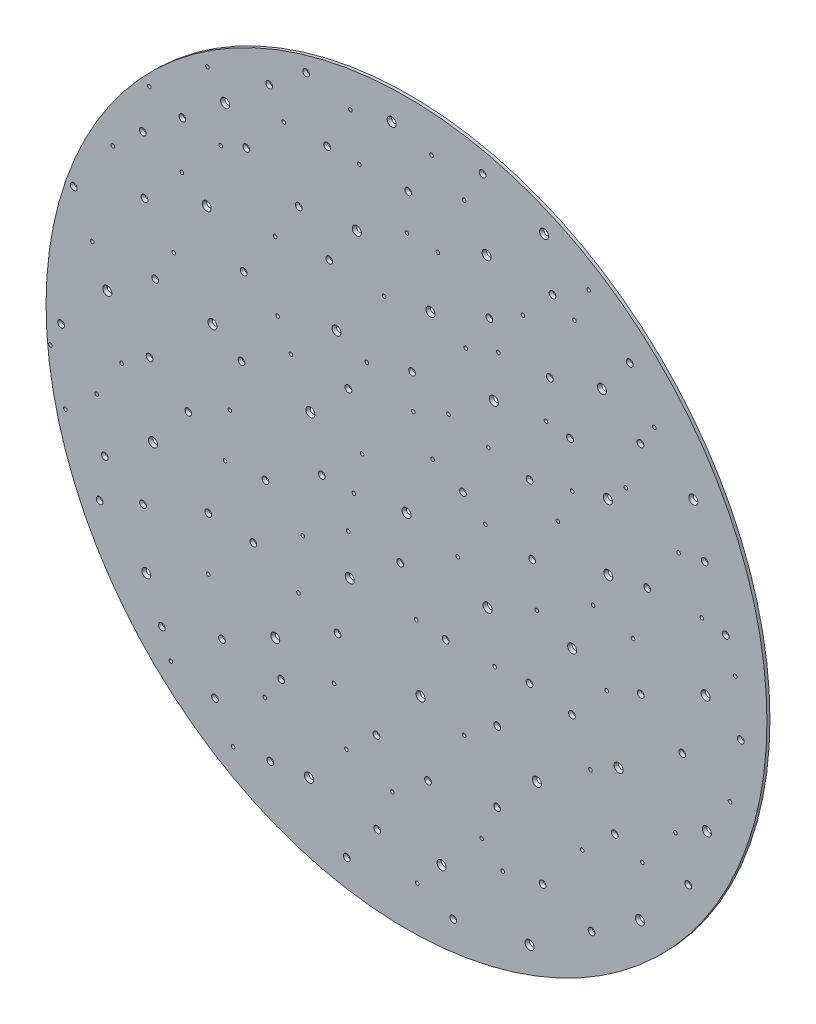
from build123d import *

# Parameters (mm, degrees)
SKIZZE1_R                       = 1200
AUFSATZ_LINEAR_AUSTRAGEN1_DEPTH = 10
BOHRUNG1_AT_2_COUNT             = 2
BOHRUNG1_AT_2_PITCH             = 551.429515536
BOHRUNG1_AT_3_COUNT             = 2
BOHRUNG1_AT_3_PITCH             = 689.850266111
BOHRUNG1_AT_4_COUNT             = 2
BOHRUNG1_AT_4_PITCH             = 624.643663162
BOHRUNG1_AT_5_COUNT             = 2
BOHRUNG1_AT_5_PITCH             = 470.937249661
BOHRUNG1_AT_6_COUNT             = 2
BOHRUNG1_AT_6_PITCH             = 345.319401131
BOHRUNG1_AT_7_COUNT             = 2
BOHRUNG1_AT_7_PITCH             = 507.888471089
BOHRUNG1_AT_8_COUNT             = 2
BOHRUNG1_AT_8_PITCH             = 563.500880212
BOHRUNG1_AT_9_COUNT             = 2
BOHRUNG1_AT_9_PITCH             = 725.092301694
BOHRUNG1_AT_10_COUNT            = 2
BOHRUNG1_AT_10_PITCH            = 871.561549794
BOHRUNG1_AT_11_COUNT            = 2
BOHRUNG1_AT_11_PITCH            = 682.736484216
BOHRUNG1_AT_12_COUNT            = 2
BOHRUNG1_AT_12_PITCH            = 1067.111703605
BOHRUNG1_AT_13_COUNT            = 2
BOHRUNG1_AT_13_PITCH            = 1104.162695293
BOHRUNG1_AT_14_COUNT            = 2
BOHRUNG1_AT_14_PITCH            = 1130.280980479
BOHRUNG1_AT_15_COUNT            = 2
BOHRUNG1_AT_15_PITCH            = 749.121236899
BOHRUNG1_AT_16_COUNT            = 2
BOHRUNG1_AT_16_PITCH            = 1085.201217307
BOHRUNG1_AT_17_COUNT            = 2
BOHRUNG1_AT_17_PITCH            = 1105.12405756
BOHRUNG1_AT_18_COUNT            = 2
BOHRUNG1_AT_18_PITCH            = 1083.832933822
BOHRUNG1_AT_19_COUNT            = 2
BOHRUNG1_AT_19_PITCH            = 707.189899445
BOHRUNG1_AT_20_COUNT            = 2
BOHRUNG1_AT_20_PITCH            = 964.220349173
BOHRUNG1_AT_21_COUNT            = 2
BOHRUNG1_AT_21_PITCH            = 980.999459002
BOHRUNG1_AT_22_COUNT            = 2
BOHRUNG1_AT_22_PITCH            = 1057.601972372
BOHRUNG1_AT_23_COUNT            = 2
BOHRUNG1_AT_23_PITCH            = 340.200565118
BOHRUNG1_AT_24_COUNT            = 2
BOHRUNG1_AT_24_PITCH            = 303.082121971
BOHRUNG1_AT_25_COUNT            = 2
BOHRUNG1_AT_25_PITCH            = 996.026604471
BOHRUNG1_AT_26_COUNT            = 2
BOHRUNG1_AT_26_PITCH            = 943.061642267
BOHRUNG1_AT_27_COUNT            = 2
BOHRUNG1_AT_27_PITCH            = 864.414824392
BOHRUNG1_AT_28_COUNT            = 2
BOHRUNG1_AT_28_PITCH            = 1006.129190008
BOHRUNG1_AT_29_COUNT            = 2
BOHRUNG1_AT_29_PITCH            = 1118.521586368
BOHRUNG1_AT_30_COUNT            = 2
BOHRUNG1_AT_30_PITCH            = 802.606587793
BOHRUNG1_AT_31_COUNT            = 2
BOHRUNG1_AT_31_PITCH            = 768.028661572
BOHRUNG1_AT_32_COUNT            = 2
BOHRUNG1_AT_32_PITCH            = 916.358242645
BOHRUNG7_AT_2_COUNT             = 2
BOHRUNG7_AT_2_PITCH             = 778.691861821
BOHRUNG7_AT_3_COUNT             = 2
BOHRUNG7_AT_3_PITCH             = 775.924424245
BOHRUNG7_AT_4_COUNT             = 2
BOHRUNG7_AT_4_PITCH             = 1117.059951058
BOHRUNG7_AT_5_COUNT             = 2
BOHRUNG7_AT_5_PITCH             = 1106.796683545
BOHRUNG7_AT_6_COUNT             = 2
BOHRUNG7_AT_6_PITCH             = 942.516952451
BOHRUNG7_AT_7_COUNT             = 2
BOHRUNG7_AT_7_PITCH             = 720.666070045
BOHRUNG7_AT_8_COUNT             = 2
BOHRUNG7_AT_8_PITCH             = 976.629632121
BOHRUNG7_AT_9_COUNT             = 2
BOHRUNG7_AT_9_PITCH             = 1290.23895934
BOHRUNG7_AT_10_COUNT            = 2
BOHRUNG7_AT_10_PITCH            = 1350.668422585
BOHRUNG7_AT_11_COUNT            = 2
BOHRUNG7_AT_11_PITCH            = 1151.003949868
BOHRUNG7_AT_12_COUNT            = 2
BOHRUNG7_AT_12_PITCH            = 1301.909217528
BOHRUNG7_AT_13_COUNT            = 2
BOHRUNG7_AT_13_PITCH            = 892.293044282
BOHRUNG7_AT_14_COUNT            = 2
BOHRUNG7_AT_14_PITCH            = 1151.056054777
BOHRUNG7_AT_15_COUNT            = 2
BOHRUNG7_AT_15_PITCH            = 897.73507688
BOHRUNG7_AT_16_COUNT            = 2
BOHRUNG7_AT_16_PITCH            = 1032.09855455
BOHRUNG7_AT_17_COUNT            = 2
BOHRUNG7_AT_17_PITCH            = 890.231681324
BOHRUNG7_AT_18_COUNT            = 2
BOHRUNG7_AT_18_PITCH            = 492.637382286
BOHRUNG7_AT_19_COUNT            = 2
BOHRUNG7_AT_19_PITCH            = 457.69221667
BOHRUNG7_AT_20_COUNT            = 2
BOHRUNG7_AT_20_PITCH            = 372.344031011
BOHRUNG7_AT_21_COUNT            = 2
BOHRUNG7_AT_21_PITCH            = 744.688062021
BOHRUNG7_AT_22_COUNT            = 2
BOHRUNG7_AT_22_PITCH            = 505.811188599
BOHRUNG7_AT_23_COUNT            = 2
BOHRUNG7_AT_23_PITCH            = 894.475248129
BOHRUNG7_AT_24_COUNT            = 2
BOHRUNG7_AT_24_PITCH            = 312.477112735
BOHRUNG7_AT_25_COUNT            = 2
BOHRUNG7_AT_25_PITCH            = 797.136127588
BOHRUNG7_AT_26_COUNT            = 2
BOHRUNG7_AT_26_PITCH            = 1082.90950687
BOHRUNG7_AT_27_COUNT            = 2
BOHRUNG7_AT_27_PITCH            = 952.976866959
BOHRUNG7_AT_28_COUNT            = 2
BOHRUNG7_AT_28_PITCH            = 555.745457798
BOHRUNG7_AT_29_COUNT            = 2
BOHRUNG7_AT_29_PITCH            = 777.990810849
BOHRUNG7_AT_30_COUNT            = 2
BOHRUNG7_AT_30_PITCH            = 855.018832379
BOHRUNG7_AT_31_COUNT            = 2
BOHRUNG7_AT_31_PITCH            = 733.878421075
BOHRUNG7_AT_32_COUNT            = 2
BOHRUNG7_AT_32_PITCH            = 265.655833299
BOHRUNG7_AT_33_COUNT            = 2
BOHRUNG7_AT_33_PITCH            = 243.188239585
BOHRUNG7_AT_34_COUNT            = 2
BOHRUNG7_AT_34_PITCH            = 396.378272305
BOHRUNG7_AT_35_COUNT            = 2
BOHRUNG7_AT_35_PITCH            = 737.621872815
BOHRUNG7_AT_36_COUNT            = 2
BOHRUNG7_AT_36_PITCH            = 1317.113271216
BOHRUNG7_AT_37_COUNT            = 2
BOHRUNG7_AT_37_PITCH            = 1037.242165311
BOHRUNG7_AT_38_COUNT            = 2
BOHRUNG7_AT_38_PITCH            = 1270.464846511
BOHRUNG7_AT_39_COUNT            = 2
BOHRUNG7_AT_39_PITCH            = 830.010095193
BOHRUNG7_AT_40_COUNT            = 2
BOHRUNG7_AT_40_PITCH            = 958.291678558
BOHRUNG7_AT_41_COUNT            = 2
BOHRUNG7_AT_41_PITCH            = 657.225829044
BOHRUNG7_AT_42_COUNT            = 2
BOHRUNG7_AT_42_PITCH            = 614.005587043
BOHRUNG7_AT_43_COUNT            = 2
BOHRUNG7_AT_43_PITCH            = 875.197635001
BOHRUNG7_AT_44_COUNT            = 2
BOHRUNG7_AT_44_PITCH            = 826.70612876
BOHRUNG7_AT_45_COUNT            = 2
BOHRUNG7_AT_45_PITCH            = 859.164110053
BOHRUNG7_AT_46_COUNT            = 2
BOHRUNG7_AT_46_PITCH            = 1305.195829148
BOHRUNG7_AT_47_COUNT            = 2
BOHRUNG7_AT_47_PITCH            = 1207.05311287
BOHRUNG7_AT_48_COUNT            = 2
BOHRUNG7_AT_48_PITCH            = 1029.91311707
BOHRUNG7_AT_49_COUNT            = 2
BOHRUNG7_AT_49_PITCH            = 1180.117131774
BOHRUNG7_AT_50_COUNT            = 2
BOHRUNG7_AT_50_PITCH            = 1069.024555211
BOHRUNG7_AT_51_COUNT            = 2
BOHRUNG7_AT_51_PITCH            = 552.788574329
BOHRUNG7_AT_52_COUNT            = 2
BOHRUNG7_AT_52_PITCH            = 855.651178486
BOHRUNG7_AT_53_COUNT            = 2
BOHRUNG7_AT_53_PITCH            = 1065.341874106
BOHRUNG7_AT_54_COUNT            = 2
BOHRUNG7_AT_54_PITCH            = 1136.220449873
BOHRUNG7_AT_55_COUNT            = 2
BOHRUNG7_AT_55_PITCH            = 1247.337552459
BOHRUNG7_AT_56_COUNT            = 2
BOHRUNG7_AT_56_PITCH            = 1340.177906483
BOHRUNG7_AT_57_COUNT            = 2
BOHRUNG7_AT_57_PITCH            = 1363.423843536
BOHRUNG7_AT_58_COUNT            = 2
BOHRUNG7_AT_58_PITCH            = 1052.047366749
BOHRUNG7_AT_59_COUNT            = 2
BOHRUNG7_AT_59_PITCH            = 488.000798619
BOHRUNG7_AT_60_COUNT            = 2
BOHRUNG7_AT_60_PITCH            = 631.216992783
BOHRUNG7_AT_61_COUNT            = 2
BOHRUNG7_AT_61_PITCH            = 958.947894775
BOHRUNG7_AT_62_COUNT            = 2
BOHRUNG7_AT_62_PITCH            = 627.398237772
BOHRUNG7_AT_63_COUNT            = 2
BOHRUNG7_AT_63_PITCH            = 585.955697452
BOHRUNG9_AT_2_COUNT             = 2
BOHRUNG9_AT_2_PITCH             = 495.770579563
BOHRUNG9_AT_3_COUNT             = 2
BOHRUNG9_AT_3_PITCH             = 297.699678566
BOHRUNG9_AT_4_COUNT             = 2
BOHRUNG9_AT_4_PITCH             = 737.571021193
BOHRUNG9_AT_5_COUNT             = 2
BOHRUNG9_AT_5_PITCH             = 371.115137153
BOHRUNG9_AT_6_COUNT             = 2
BOHRUNG9_AT_6_PITCH             = 921.353775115
BOHRUNG9_AT_7_COUNT             = 2
BOHRUNG9_AT_7_PITCH             = 869.723133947
BOHRUNG9_AT_8_COUNT             = 2
BOHRUNG9_AT_8_PITCH             = 913.970953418
BOHRUNG9_AT_9_COUNT             = 2
BOHRUNG9_AT_9_PITCH             = 1049.746683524
BOHRUNG9_AT_10_COUNT            = 2
BOHRUNG9_AT_10_PITCH            = 1156.624186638
BOHRUNG9_AT_11_COUNT            = 2
BOHRUNG9_AT_11_PITCH            = 1188.753054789
BOHRUNG9_AT_12_COUNT            = 2
BOHRUNG9_AT_12_PITCH            = 1021.656905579
BOHRUNG9_AT_13_COUNT            = 2
BOHRUNG9_AT_13_PITCH            = 642.695286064
BOHRUNG9_AT_14_COUNT            = 2
BOHRUNG9_AT_14_PITCH            = 986.120675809
BOHRUNG9_AT_15_COUNT            = 2
BOHRUNG9_AT_15_PITCH            = 1151.443829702
BOHRUNG9_AT_16_COUNT            = 2
BOHRUNG9_AT_16_PITCH            = 1198.960369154
BOHRUNG9_AT_17_COUNT            = 2
BOHRUNG9_AT_17_PITCH            = 1320.640478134
BOHRUNG9_AT_18_COUNT            = 2
BOHRUNG9_AT_18_PITCH            = 1427.302260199
BOHRUNG9_AT_19_COUNT            = 2
BOHRUNG9_AT_19_PITCH            = 679.657330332
BOHRUNG9_AT_20_COUNT            = 2
BOHRUNG9_AT_20_PITCH            = 271.978716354
BOHRUNG9_AT_21_COUNT            = 2
BOHRUNG9_AT_21_PITCH            = 584.700195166
BOHRUNG9_AT_22_COUNT            = 2
BOHRUNG9_AT_22_PITCH            = 271.916731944
BOHRUNG9_AT_23_COUNT            = 2
BOHRUNG9_AT_23_PITCH            = 226.801121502
BOHRUNG9_AT_24_COUNT            = 2
BOHRUNG9_AT_24_PITCH            = 558.795810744
BOHRUNG9_AT_25_COUNT            = 2
BOHRUNG9_AT_25_PITCH            = 703.285621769
BOHRUNG9_AT_26_COUNT            = 2
BOHRUNG9_AT_26_PITCH            = 791.847043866
BOHRUNG9_AT_27_COUNT            = 2
BOHRUNG9_AT_27_PITCH            = 273.186527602
BOHRUNG9_AT_28_COUNT            = 2
BOHRUNG9_AT_28_PITCH            = 643.262207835
BOHRUNG9_AT_29_COUNT            = 2
BOHRUNG9_AT_29_PITCH            = 702.225031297
BOHRUNG9_AT_30_COUNT            = 2
BOHRUNG9_AT_30_PITCH            = 477.396304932
BOHRUNG9_AT_31_COUNT            = 2
BOHRUNG9_AT_31_PITCH            = 508.876332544
BOHRUNG9_AT_32_COUNT            = 2
BOHRUNG9_AT_32_PITCH            = 711.820587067
BOHRUNG9_AT_33_COUNT            = 2
BOHRUNG9_AT_33_PITCH            = 789.133197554
BOHRUNG9_AT_34_COUNT            = 2
BOHRUNG9_AT_34_PITCH            = 969.022776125
BOHRUNG9_AT_35_COUNT            = 2
BOHRUNG9_AT_35_PITCH            = 1268.970789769
BOHRUNG9_AT_36_COUNT            = 2
BOHRUNG9_AT_36_PITCH            = 1094.140037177
BOHRUNG9_AT_37_COUNT            = 2
BOHRUNG9_AT_37_PITCH            = 1328.243354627
BOHRUNG9_AT_38_COUNT            = 2
BOHRUNG9_AT_38_PITCH            = 1344.295230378
BOHRUNG9_AT_39_COUNT            = 2
BOHRUNG9_AT_39_PITCH            = 967.858878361
BOHRUNG9_AT_40_COUNT            = 2
BOHRUNG9_AT_40_PITCH            = 819.574600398
BOHRUNG9_AT_41_COUNT            = 2
BOHRUNG9_AT_41_PITCH            = 953.669063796
BOHRUNG9_AT_42_COUNT            = 2
BOHRUNG9_AT_42_PITCH            = 1129.100921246
BOHRUNG9_AT_43_COUNT            = 2
BOHRUNG9_AT_43_PITCH            = 1378.033243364
BOHRUNG9_AT_44_COUNT            = 2
BOHRUNG9_AT_44_PITCH            = 1260.23685631
BOHRUNG9_AT_45_COUNT            = 2
BOHRUNG9_AT_45_PITCH            = 864.833681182
BOHRUNG9_AT_46_COUNT            = 2
BOHRUNG9_AT_46_PITCH            = 1038.155824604
BOHRUNG9_AT_47_COUNT            = 2
BOHRUNG9_AT_47_PITCH            = 999.881731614
BOHRUNG9_AT_48_COUNT            = 2
BOHRUNG9_AT_48_PITCH            = 683.860884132
BOHRUNG9_AT_49_COUNT            = 2
BOHRUNG9_AT_49_PITCH            = 651.160934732
BOHRUNG9_AT_50_COUNT            = 2
BOHRUNG9_AT_50_PITCH            = 652.87805114
BOHRUNG9_AT_51_COUNT            = 2
BOHRUNG9_AT_51_PITCH            = 937.554273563
BOHRUNG9_AT_52_COUNT            = 2
BOHRUNG9_AT_52_PITCH            = 834.135644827
BOHRUNG9_AT_53_COUNT            = 2
BOHRUNG9_AT_53_PITCH            = 609.957819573
BOHRUNG9_AT_54_COUNT            = 2
BOHRUNG9_AT_54_PITCH            = 406.773333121
BOHRUNG9_AT_55_COUNT            = 2
BOHRUNG9_AT_55_PITCH            = 167.264829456
BOHRUNG9_AT_56_COUNT            = 2
BOHRUNG9_AT_56_PITCH            = 401.534308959
BOHRUNG9_AT_57_COUNT            = 2
BOHRUNG9_AT_57_PITCH            = 276.646344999
BOHRUNG9_AT_58_COUNT            = 2
BOHRUNG9_AT_58_PITCH            = 521.131151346
BOHRUNG9_AT_59_COUNT            = 2
BOHRUNG9_AT_59_PITCH            = 811.05853425
BOHRUNG9_AT_60_COUNT            = 2
BOHRUNG9_AT_60_PITCH            = 707.994460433
BOHRUNG9_AT_61_COUNT            = 2
BOHRUNG9_AT_61_PITCH            = 388.05046838
BOHRUNG9_AT_62_COUNT            = 2
BOHRUNG9_AT_62_PITCH            = 502.688209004
BOHRUNG9_AT_63_COUNT            = 2
BOHRUNG9_AT_63_PITCH            = 459.539522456
BOHRUNG9_AT_64_COUNT            = 2
BOHRUNG9_AT_64_PITCH            = 619.973684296
BOHRUNG9_AT_65_COUNT            = 2
BOHRUNG9_AT_65_PITCH            = 618.933085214
BOHRUNG9_AT_66_COUNT            = 2
BOHRUNG9_AT_66_PITCH            = 661.01535915
BOHRUNG9_AT_67_COUNT            = 2
BOHRUNG9_AT_67_PITCH            = 844.007979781
BOHRUNG9_AT_68_COUNT            = 2
BOHRUNG9_AT_68_PITCH            = 1185.582954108
BOHRUNG9_AT_69_COUNT            = 2
BOHRUNG9_AT_69_PITCH            = 1403.289340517
BOHRUNG9_AT_70_COUNT            = 2
BOHRUNG9_AT_70_PITCH            = 1355.144521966
BOHRUNG9_AT_71_COUNT            = 2
BOHRUNG9_AT_71_PITCH            = 1241.430059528


with BuildPart() as part:
    # Skizze1 → Aufsatz-Linear austragen1 (new body)
    with BuildSketch(Plane.XY):
        Circle(SKIZZE1_R)
    extrude(amount=-AUFSATZ_LINEAR_AUSTRAGEN1_DEPTH)

    # Skizze3 → Bohrung1 (revolve, cut)
    with BuildSketch(Plane(origin=(0, 0, 0), x_dir=(0, -1, 0), z_dir=(1, 0, 0))):
        Polygon((0, 0), (0, 16.00860619), (10, 10), (15, 0), align=None)
    bohrung1 = revolve(axis=Axis((0, 0, 9.901672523), (0, 0, -1)), mode=Mode.SUBTRACT)

    # Bohrung1 at 2: Bohrung1 ×2
    with Locations(*[Vector(0.5271354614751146, 0.849781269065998, 0) * (i * BOHRUNG1_AT_2_PITCH) for i in range(1, BOHRUNG1_AT_2_COUNT)]):
        add(bohrung1, mode=Mode.SUBTRACT)

    # Bohrung1 at 3: Bohrung1 ×2
    with Locations(*[Vector(0.9738412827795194, 0.2272293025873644, 0) * (i * BOHRUNG1_AT_3_PITCH) for i in range(1, BOHRUNG1_AT_3_COUNT)]):
        add(bohrung1, mode=Mode.SUBTRACT)

    # Bohrung1 at 4: Bohrung1 ×2
    with Locations(*[Vector(0.12792504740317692, 0.9917838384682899, 0) * (i * BOHRUNG1_AT_4_PITCH) for i in range(1, BOHRUNG1_AT_4_COUNT)]):
        add(bohrung1, mode=Mode.SUBTRACT)

    # Bohrung1 at 5: Bohrung1 ×2
    with Locations(*[Vector(-0.4948777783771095, 0.868962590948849, 0) * (i * BOHRUNG1_AT_5_PITCH) for i in range(1, BOHRUNG1_AT_5_COUNT)]):
        add(bohrung1, mode=Mode.SUBTRACT)

    # Bohrung1 at 6: Bohrung1 ×2
    with Locations(*[Vector(-0.9265125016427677, 0.37626398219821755, 0) * (i * BOHRUNG1_AT_6_PITCH) for i in range(1, BOHRUNG1_AT_6_COUNT)]):
        add(bohrung1, mode=Mode.SUBTRACT)

    # Bohrung1 at 7: Bohrung1 ×2
    with Locations(*[Vector(0.09238634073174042, -0.9957232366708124, 0) * (i * BOHRUNG1_AT_7_PITCH) for i in range(1, BOHRUNG1_AT_7_COUNT)]):
        add(bohrung1, mode=Mode.SUBTRACT)

    # Bohrung1 at 8: Bohrung1 ×2
    with Locations(*[Vector(0.9788925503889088, -0.2043755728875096, 0) * (i * BOHRUNG1_AT_8_PITCH) for i in range(1, BOHRUNG1_AT_8_COUNT)]):
        add(bohrung1, mode=Mode.SUBTRACT)

    # Bohrung1 at 9: Bohrung1 ×2
    with Locations(*[Vector(-0.6026113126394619, -0.7980348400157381, 0) * (i * BOHRUNG1_AT_9_PITCH) for i in range(1, BOHRUNG1_AT_9_COUNT)]):
        add(bohrung1, mode=Mode.SUBTRACT)

    # Bohrung1 at 10: Bohrung1 ×2
    with Locations(*[Vector(-0.9680709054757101, -0.2506765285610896, 0) * (i * BOHRUNG1_AT_10_PITCH) for i in range(1, BOHRUNG1_AT_10_COUNT)]):
        add(bohrung1, mode=Mode.SUBTRACT)

    # Bohrung1 at 11: Bohrung1 ×2
    with Locations(*[Vector(-0.9461260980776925, 0.3237984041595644, 0) * (i * BOHRUNG1_AT_11_PITCH) for i in range(1, BOHRUNG1_AT_11_COUNT)]):
        add(bohrung1, mode=Mode.SUBTRACT)

    # Bohrung1 at 12: Bohrung1 ×2
    with Locations(*[Vector(-0.565803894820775, 0.8245398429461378, 0) * (i * BOHRUNG1_AT_12_PITCH) for i in range(1, BOHRUNG1_AT_12_COUNT)]):
        add(bohrung1, mode=Mode.SUBTRACT)

    # Bohrung1 at 13: Bohrung1 ×2
    with Locations(*[Vector(-0.04476452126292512, 0.9989975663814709, 0) * (i * BOHRUNG1_AT_13_PITCH) for i in range(1, BOHRUNG1_AT_13_COUNT)]):
        add(bohrung1, mode=Mode.SUBTRACT)

    # Bohrung1 at 14: Bohrung1 ×2
    with Locations(*[Vector(0.4051192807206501, 0.9142638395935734, 0) * (i * BOHRUNG1_AT_14_PITCH) for i in range(1, BOHRUNG1_AT_14_COUNT)]):
        add(bohrung1, mode=Mode.SUBTRACT)

    # Bohrung1 at 15: Bohrung1 ×2
    with Locations(*[Vector(-0.22062623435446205, 0.9753584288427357, 0) * (i * BOHRUNG1_AT_15_PITCH) for i in range(1, BOHRUNG1_AT_15_COUNT)]):
        add(bohrung1, mode=Mode.SUBTRACT)

    # Bohrung1 at 16: Bohrung1 ×2
    with Locations(*[Vector(0.8798011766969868, 0.47534186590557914, 0) * (i * BOHRUNG1_AT_16_PITCH) for i in range(1, BOHRUNG1_AT_16_COUNT)]):
        add(bohrung1, mode=Mode.SUBTRACT)

    # Bohrung1 at 17: Bohrung1 ×2
    with Locations(*[Vector(0.7031077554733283, -0.7110833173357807, 0) * (i * BOHRUNG1_AT_17_PITCH) for i in range(1, BOHRUNG1_AT_17_COUNT)]):
        add(bohrung1, mode=Mode.SUBTRACT)

    # Bohrung1 at 18: Bohrung1 ×2
    with Locations(*[Vector(0.9225657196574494, -0.38583998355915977, 0) * (i * BOHRUNG1_AT_18_PITCH) for i in range(1, BOHRUNG1_AT_18_COUNT)]):
        add(bohrung1, mode=Mode.SUBTRACT)

    # Bohrung1 at 19: Bohrung1 ×2
    with Locations(*[Vector(0.6138467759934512, -0.7894251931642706, 0) * (i * BOHRUNG1_AT_19_PITCH) for i in range(1, BOHRUNG1_AT_19_COUNT)]):
        add(bohrung1, mode=Mode.SUBTRACT)

    # Bohrung1 at 20: Bohrung1 ×2
    with Locations(*[Vector(0.12106850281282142, -0.9926441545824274, 0) * (i * BOHRUNG1_AT_20_PITCH) for i in range(1, BOHRUNG1_AT_20_COUNT)]):
        add(bohrung1, mode=Mode.SUBTRACT)

    # Bohrung1 at 21: Bohrung1 ×2
    with Locations(*[Vector(-0.33080235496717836, -0.9437000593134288, 0) * (i * BOHRUNG1_AT_21_PITCH) for i in range(1, BOHRUNG1_AT_21_COUNT)]):
        add(bohrung1, mode=Mode.SUBTRACT)

    # Bohrung1 at 22: Bohrung1 ×2
    with Locations(*[Vector(-0.8190222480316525, -0.5737617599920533, 0) * (i * BOHRUNG1_AT_22_PITCH) for i in range(1, BOHRUNG1_AT_22_COUNT)]):
        add(bohrung1, mode=Mode.SUBTRACT)

    # Bohrung1 at 23: Bohrung1 ×2
    with Locations(*[Vector(-0.5554246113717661, -0.8315668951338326, 0) * (i * BOHRUNG1_AT_23_PITCH) for i in range(1, BOHRUNG1_AT_23_COUNT)]):
        add(bohrung1, mode=Mode.SUBTRACT)

    # Bohrung1 at 24: Bohrung1 ×2
    with Locations(*[Vector(0.8902134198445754, -0.4555437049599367, 0) * (i * BOHRUNG1_AT_24_PITCH) for i in range(1, BOHRUNG1_AT_24_COUNT)]):
        add(bohrung1, mode=Mode.SUBTRACT)

    # Bohrung1 at 25: Bohrung1 ×2
    with Locations(*[Vector(0.9995856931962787, -0.02878266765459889, 0) * (i * BOHRUNG1_AT_25_PITCH) for i in range(1, BOHRUNG1_AT_25_COUNT)]):
        add(bohrung1, mode=Mode.SUBTRACT)

    # Bohrung1 at 26: Bohrung1 ×2
    with Locations(*[Vector(0.6898896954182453, 0.7239145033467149, 0) * (i * BOHRUNG1_AT_26_PITCH) for i in range(1, BOHRUNG1_AT_26_COUNT)]):
        add(bohrung1, mode=Mode.SUBTRACT)

    # Bohrung1 at 27: Bohrung1 ×2
    with Locations(*[Vector(-0.7693116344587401, 0.638873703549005, 0) * (i * BOHRUNG1_AT_27_PITCH) for i in range(1, BOHRUNG1_AT_27_COUNT)]):
        add(bohrung1, mode=Mode.SUBTRACT)

    # Bohrung1 at 28: Bohrung1 ×2
    with Locations(*[Vector(-0.9899612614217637, 0.1413389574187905, 0) * (i * BOHRUNG1_AT_28_PITCH) for i in range(1, BOHRUNG1_AT_28_COUNT)]):
        add(bohrung1, mode=Mode.SUBTRACT)

    # Bohrung1 at 29: Bohrung1 ×2
    with Locations(*[Vector(0.36605219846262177, -0.9305943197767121, 0) * (i * BOHRUNG1_AT_29_PITCH) for i in range(1, BOHRUNG1_AT_29_COUNT)]):
        add(bohrung1, mode=Mode.SUBTRACT)

    # Bohrung1 at 30: Bohrung1 ×2
    with Locations(*[Vector(0.8797649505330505, -0.475408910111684, 0) * (i * BOHRUNG1_AT_30_PITCH) for i in range(1, BOHRUNG1_AT_30_COUNT)]):
        add(bohrung1, mode=Mode.SUBTRACT)

    # Bohrung1 at 31: Bohrung1 ×2
    with Locations(*[Vector(0.872635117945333, 0.4883727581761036, 0) * (i * BOHRUNG1_AT_31_PITCH) for i in range(1, BOHRUNG1_AT_31_COUNT)]):
        add(bohrung1, mode=Mode.SUBTRACT)

    # Bohrung1 at 32: Bohrung1 ×2
    with Locations(*[Vector(0.2910743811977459, 0.9567004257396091, 0) * (i * BOHRUNG1_AT_32_PITCH) for i in range(1, BOHRUNG1_AT_32_COUNT)]):
        add(bohrung1, mode=Mode.SUBTRACT)

    # Skizze14 → Bohrung7 (revolve, cut)
    with BuildSketch(Plane(origin=(188.194538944, 153.573437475, 0), x_dir=(0, -1, 0), z_dir=(1, 0, 0))):
        Polygon((0, 0), (0, 10), (7.5, 10), (11.25, 0), align=None)
    bohrung7 = revolve(axis=Axis((188.194538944, 153.573437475, -110), (0, 0, 1)), mode=Mode.SUBTRACT)

    # Bohrung7 at 2: Bohrung7 ×2
    with Locations(*[Vector(-0.9377242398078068, 0.34738055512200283, 0) * (i * BOHRUNG7_AT_2_PITCH) for i in range(1, BOHRUNG7_AT_2_COUNT)]):
        add(bohrung7, mode=Mode.SUBTRACT)

    # Bohrung7 at 3: Bohrung7 ×2
    with Locations(*[Vector(-0.7049510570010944, 0.7092559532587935, 0) * (i * BOHRUNG7_AT_3_PITCH) for i in range(1, BOHRUNG7_AT_3_COUNT)]):
        add(bohrung7, mode=Mode.SUBTRACT)

    # Bohrung7 at 4: Bohrung7 ×2
    with Locations(*[Vector(-0.8363988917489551, 0.5481212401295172, 0) * (i * BOHRUNG7_AT_4_PITCH) for i in range(1, BOHRUNG7_AT_4_COUNT)]):
        add(bohrung7, mode=Mode.SUBTRACT)

    # Bohrung7 at 5: Bohrung7 ×2
    with Locations(*[Vector(-0.9580383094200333, 0.2866401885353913, 0) * (i * BOHRUNG7_AT_5_PITCH) for i in range(1, BOHRUNG7_AT_5_COUNT)]):
        add(bohrung7, mode=Mode.SUBTRACT)

    # Bohrung7 at 6: Bohrung7 ×2
    with Locations(*[Vector(-0.9708322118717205, -0.2397599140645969, 0) * (i * BOHRUNG7_AT_6_PITCH) for i in range(1, BOHRUNG7_AT_6_COUNT)]):
        add(bohrung7, mode=Mode.SUBTRACT)

    # Bohrung7 at 7: Bohrung7 ×2
    with Locations(*[Vector(-0.9127524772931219, -0.40851305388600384, 0) * (i * BOHRUNG7_AT_7_PITCH) for i in range(1, BOHRUNG7_AT_7_COUNT)]):
        add(bohrung7, mode=Mode.SUBTRACT)

    # Bohrung7 at 8: Bohrung7 ×2
    with Locations(*[Vector(-0.8683619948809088, -0.4959308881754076, 0) * (i * BOHRUNG7_AT_8_PITCH) for i in range(1, BOHRUNG7_AT_8_COUNT)]):
        add(bohrung7, mode=Mode.SUBTRACT)

    # Bohrung7 at 9: Bohrung7 ×2
    with Locations(*[Vector(-0.9242981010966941, -0.3816713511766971, 0) * (i * BOHRUNG7_AT_9_PITCH) for i in range(1, BOHRUNG7_AT_9_COUNT)]):
        add(bohrung7, mode=Mode.SUBTRACT)

    # Bohrung7 at 10: Bohrung7 ×2
    with Locations(*[Vector(-0.9906928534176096, -0.13611638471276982, 0) * (i * BOHRUNG7_AT_10_PITCH) for i in range(1, BOHRUNG7_AT_10_COUNT)]):
        add(bohrung7, mode=Mode.SUBTRACT)

    # Bohrung7 at 11: Bohrung7 ×2
    with Locations(*[Vector(-0.6973245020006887, -0.7167555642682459, 0) * (i * BOHRUNG7_AT_11_PITCH) for i in range(1, BOHRUNG7_AT_11_COUNT)]):
        add(bohrung7, mode=Mode.SUBTRACT)

    # Bohrung7 at 12: Bohrung7 ×2
    with Locations(*[Vector(-0.6341856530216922, -0.7731808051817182, 0) * (i * BOHRUNG7_AT_12_PITCH) for i in range(1, BOHRUNG7_AT_12_COUNT)]):
        add(bohrung7, mode=Mode.SUBTRACT)

    # Bohrung7 at 13: Bohrung7 ×2
    with Locations(*[Vector(-0.32281876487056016, -0.9464607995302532, 0) * (i * BOHRUNG7_AT_13_PITCH) for i in range(1, BOHRUNG7_AT_13_COUNT)]):
        add(bohrung7, mode=Mode.SUBTRACT)

    # Bohrung7 at 14: Bohrung7 ×2
    with Locations(*[Vector(-0.24796858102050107, -0.9687680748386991, 0) * (i * BOHRUNG7_AT_14_PITCH) for i in range(1, BOHRUNG7_AT_14_COUNT)]):
        add(bohrung7, mode=Mode.SUBTRACT)

    # Bohrung7 at 15: Bohrung7 ×2
    with Locations(*[Vector(-0.12983587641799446, -0.9915354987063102, 0) * (i * BOHRUNG7_AT_15_PITCH) for i in range(1, BOHRUNG7_AT_15_COUNT)]):
        add(bohrung7, mode=Mode.SUBTRACT)

    # Bohrung7 at 16: Bohrung7 ×2
    with Locations(*[Vector(0.25676183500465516, -0.9664747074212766, 0) * (i * BOHRUNG7_AT_16_PITCH) for i in range(1, BOHRUNG7_AT_16_COUNT)]):
        add(bohrung7, mode=Mode.SUBTRACT)

    # Bohrung7 at 17: Bohrung7 ×2
    with Locations(*[Vector(0.5676910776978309, -0.8232416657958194, 0) * (i * BOHRUNG7_AT_17_PITCH) for i in range(1, BOHRUNG7_AT_17_COUNT)]):
        add(bohrung7, mode=Mode.SUBTRACT)

    # Bohrung7 at 18: Bohrung7 ×2
    with Locations(*[Vector(0.4489647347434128, -0.8935494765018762, 0) * (i * BOHRUNG7_AT_18_PITCH) for i in range(1, BOHRUNG7_AT_18_COUNT)]):
        add(bohrung7, mode=Mode.SUBTRACT)

    # Bohrung7 at 19: Bohrung7 ×2
    with Locations(*[Vector(-0.1257880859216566, -0.9920571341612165, 0) * (i * BOHRUNG7_AT_19_PITCH) for i in range(1, BOHRUNG7_AT_19_COUNT)]):
        add(bohrung7, mode=Mode.SUBTRACT)

    # Bohrung7 at 20: Bohrung7 ×2
    with Locations(*[Vector(-0.5612114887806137, -0.8276724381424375, 0) * (i * BOHRUNG7_AT_20_PITCH) for i in range(1, BOHRUNG7_AT_20_COUNT)]):
        add(bohrung7, mode=Mode.SUBTRACT)

    # Bohrung7 at 21: Bohrung7 ×2
    with Locations(*[Vector(-0.561211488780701, -0.8276724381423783, 0) * (i * BOHRUNG7_AT_21_PITCH) for i in range(1, BOHRUNG7_AT_21_COUNT)]):
        add(bohrung7, mode=Mode.SUBTRACT)

    # Bohrung7 at 22: Bohrung7 ×2
    with Locations(*[Vector(-0.9300725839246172, -0.36737581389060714, 0) * (i * BOHRUNG7_AT_22_PITCH) for i in range(1, BOHRUNG7_AT_22_COUNT)]):
        add(bohrung7, mode=Mode.SUBTRACT)

    # Bohrung7 at 23: Bohrung7 ×2
    with Locations(*[Vector(-0.5058321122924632, 0.8626319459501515, 0) * (i * BOHRUNG7_AT_23_PITCH) for i in range(1, BOHRUNG7_AT_23_COUNT)]):
        add(bohrung7, mode=Mode.SUBTRACT)

    # Bohrung7 at 24: Bohrung7 ×2
    with Locations(*[Vector(-0.543632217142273, 0.8393235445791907, 0) * (i * BOHRUNG7_AT_24_PITCH) for i in range(1, BOHRUNG7_AT_24_COUNT)]):
        add(bohrung7, mode=Mode.SUBTRACT)

    # Bohrung7 at 25: Bohrung7 ×2
    with Locations(*[Vector(-0.2286811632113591, 0.9735013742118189, 0) * (i * BOHRUNG7_AT_25_PITCH) for i in range(1, BOHRUNG7_AT_25_COUNT)]):
        add(bohrung7, mode=Mode.SUBTRACT)

    # Bohrung7 at 26: Bohrung7 ×2
    with Locations(*[Vector(-0.4823503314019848, 0.875978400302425, 0) * (i * BOHRUNG7_AT_26_PITCH) for i in range(1, BOHRUNG7_AT_26_COUNT)]):
        add(bohrung7, mode=Mode.SUBTRACT)

    # Bohrung7 at 27: Bohrung7 ×2
    with Locations(*[Vector(0.06836668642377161, 0.9976602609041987, 0) * (i * BOHRUNG7_AT_27_PITCH) for i in range(1, BOHRUNG7_AT_27_COUNT)]):
        add(bohrung7, mode=Mode.SUBTRACT)

    # Bohrung7 at 28: Bohrung7 ×2
    with Locations(*[Vector(0.5203033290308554, 0.8539815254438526, 0) * (i * BOHRUNG7_AT_28_PITCH) for i in range(1, BOHRUNG7_AT_28_COUNT)]):
        add(bohrung7, mode=Mode.SUBTRACT)

    # Bohrung7 at 29: Bohrung7 ×2
    with Locations(*[Vector(0.38296762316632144, 0.9237617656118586, 0) * (i * BOHRUNG7_AT_29_PITCH) for i in range(1, BOHRUNG7_AT_29_COUNT)]):
        add(bohrung7, mode=Mode.SUBTRACT)

    # Bohrung7 at 30: Bohrung7 ×2
    with Locations(*[Vector(0.6493206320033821, 0.7605147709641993, 0) * (i * BOHRUNG7_AT_30_PITCH) for i in range(1, BOHRUNG7_AT_30_COUNT)]):
        add(bohrung7, mode=Mode.SUBTRACT)

    # Bohrung7 at 31: Bohrung7 ×2
    with Locations(*[Vector(0.8049423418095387, 0.5933530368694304, 0) * (i * BOHRUNG7_AT_31_PITCH) for i in range(1, BOHRUNG7_AT_31_COUNT)]):
        add(bohrung7, mode=Mode.SUBTRACT)

    # Bohrung7 at 32: Bohrung7 ×2
    with Locations(*[Vector(0.8344918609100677, 0.5510202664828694, 0) * (i * BOHRUNG7_AT_32_PITCH) for i in range(1, BOHRUNG7_AT_32_COUNT)]):
        add(bohrung7, mode=Mode.SUBTRACT)

    # Bohrung7 at 33: Bohrung7 ×2
    with Locations(*[Vector(0.9460492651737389, -0.32402281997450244, 0) * (i * BOHRUNG7_AT_33_PITCH) for i in range(1, BOHRUNG7_AT_33_COUNT)]):
        add(bohrung7, mode=Mode.SUBTRACT)

    # Bohrung7 at 34: Bohrung7 ×2
    with Locations(*[Vector(-0.9626202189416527, 0.2708547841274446, 0) * (i * BOHRUNG7_AT_34_PITCH) for i in range(1, BOHRUNG7_AT_34_COUNT)]):
        add(bohrung7, mode=Mode.SUBTRACT)

    # Bohrung7 at 35: Bohrung7 ×2
    with Locations(*[Vector(-0.9999344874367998, 0.01144643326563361, 0) * (i * BOHRUNG7_AT_35_PITCH) for i in range(1, BOHRUNG7_AT_35_COUNT)]):
        add(bohrung7, mode=Mode.SUBTRACT)

    # Bohrung7 at 36: Bohrung7 ×2
    with Locations(*[Vector(-0.9841834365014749, 0.17715237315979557, 0) * (i * BOHRUNG7_AT_36_PITCH) for i in range(1, BOHRUNG7_AT_36_COUNT)]):
        add(bohrung7, mode=Mode.SUBTRACT)

    # Bohrung7 at 37: Bohrung7 ×2
    with Locations(*[Vector(-0.5836421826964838, -0.8120109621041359, 0) * (i * BOHRUNG7_AT_37_PITCH) for i in range(1, BOHRUNG7_AT_37_COUNT)]):
        add(bohrung7, mode=Mode.SUBTRACT)

    # Bohrung7 at 38: Bohrung7 ×2
    with Locations(*[Vector(-0.5048037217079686, -0.8632341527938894, 0) * (i * BOHRUNG7_AT_38_PITCH) for i in range(1, BOHRUNG7_AT_38_COUNT)]):
        add(bohrung7, mode=Mode.SUBTRACT)

    # Bohrung7 at 39: Bohrung7 ×2
    with Locations(*[Vector(0.969795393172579, 0.2439198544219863, 0) * (i * BOHRUNG7_AT_39_PITCH) for i in range(1, BOHRUNG7_AT_39_COUNT)]):
        add(bohrung7, mode=Mode.SUBTRACT)

    # Bohrung7 at 40: Bohrung7 ×2
    with Locations(*[Vector(0.9648582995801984, -0.2627707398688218, 0) * (i * BOHRUNG7_AT_40_PITCH) for i in range(1, BOHRUNG7_AT_40_COUNT)]):
        add(bohrung7, mode=Mode.SUBTRACT)

    # Bohrung7 at 41: Bohrung7 ×2
    with Locations(*[Vector(0.9000416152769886, -0.435803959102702, 0) * (i * BOHRUNG7_AT_41_PITCH) for i in range(1, BOHRUNG7_AT_41_COUNT)]):
        add(bohrung7, mode=Mode.SUBTRACT)

    # Bohrung7 at 42: Bohrung7 ×2
    with Locations(*[Vector(0.9987659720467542, 0.04966420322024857, 0) * (i * BOHRUNG7_AT_42_PITCH) for i in range(1, BOHRUNG7_AT_42_COUNT)]):
        add(bohrung7, mode=Mode.SUBTRACT)

    # Bohrung7 at 43: Bohrung7 ×2
    with Locations(*[Vector(0.9995769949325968, 0.029083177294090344, 0) * (i * BOHRUNG7_AT_43_PITCH) for i in range(1, BOHRUNG7_AT_43_COUNT)]):
        add(bohrung7, mode=Mode.SUBTRACT)

    # Bohrung7 at 44: Bohrung7 ×2
    with Locations(*[Vector(0.8831385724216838, -0.4691122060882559, 0) * (i * BOHRUNG7_AT_44_PITCH) for i in range(1, BOHRUNG7_AT_44_COUNT)]):
        add(bohrung7, mode=Mode.SUBTRACT)

    # Bohrung7 at 45: Bohrung7 ×2
    with Locations(*[Vector(0.13223550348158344, -0.9912183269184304, 0) * (i * BOHRUNG7_AT_45_PITCH) for i in range(1, BOHRUNG7_AT_45_COUNT)]):
        add(bohrung7, mode=Mode.SUBTRACT)

    # Bohrung7 at 46: Bohrung7 ×2
    with Locations(*[Vector(-0.29652944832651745, -0.955023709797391, 0) * (i * BOHRUNG7_AT_46_PITCH) for i in range(1, BOHRUNG7_AT_46_COUNT)]):
        add(bohrung7, mode=Mode.SUBTRACT)

    # Bohrung7 at 47: Bohrung7 ×2
    with Locations(*[Vector(-0.8826556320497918, -0.4700202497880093, 0) * (i * BOHRUNG7_AT_47_PITCH) for i in range(1, BOHRUNG7_AT_47_COUNT)]):
        add(bohrung7, mode=Mode.SUBTRACT)

    # Bohrung7 at 48: Bohrung7 ×2
    with Locations(*[Vector(-0.9950404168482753, 0.09947144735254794, 0) * (i * BOHRUNG7_AT_48_PITCH) for i in range(1, BOHRUNG7_AT_48_COUNT)]):
        add(bohrung7, mode=Mode.SUBTRACT)

    # Bohrung7 at 49: Bohrung7 ×2
    with Locations(*[Vector(-0.9032209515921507, 0.4291758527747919, 0) * (i * BOHRUNG7_AT_49_PITCH) for i in range(1, BOHRUNG7_AT_49_COUNT)]):
        add(bohrung7, mode=Mode.SUBTRACT)

    # Bohrung7 at 50: Bohrung7 ×2
    with Locations(*[Vector(-0.60368662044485, 0.79722171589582, 0) * (i * BOHRUNG7_AT_50_PITCH) for i in range(1, BOHRUNG7_AT_50_COUNT)]):
        add(bohrung7, mode=Mode.SUBTRACT)

    # Bohrung7 at 51: Bohrung7 ×2
    with Locations(*[Vector(0.15859579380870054, 0.9873435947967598, 0) * (i * BOHRUNG7_AT_51_PITCH) for i in range(1, BOHRUNG7_AT_51_COUNT)]):
        add(bohrung7, mode=Mode.SUBTRACT)

    # Bohrung7 at 52: Bohrung7 ×2
    with Locations(*[Vector(-0.8157391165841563, -0.5784199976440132, 0) * (i * BOHRUNG7_AT_52_PITCH) for i in range(1, BOHRUNG7_AT_52_COUNT)]):
        add(bohrung7, mode=Mode.SUBTRACT)

    # Bohrung7 at 53: Bohrung7 ×2
    with Locations(*[Vector(0.7037990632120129, -0.7103990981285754, 0) * (i * BOHRUNG7_AT_53_PITCH) for i in range(1, BOHRUNG7_AT_53_COUNT)]):
        add(bohrung7, mode=Mode.SUBTRACT)

    # Bohrung7 at 54: Bohrung7 ×2
    with Locations(*[Vector(0.37660780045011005, -0.926372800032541, 0) * (i * BOHRUNG7_AT_54_PITCH) for i in range(1, BOHRUNG7_AT_54_COUNT)]):
        add(bohrung7, mode=Mode.SUBTRACT)

    # Bohrung7 at 55: Bohrung7 ×2
    with Locations(*[Vector(-0.026082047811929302, -0.9996598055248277, 0) * (i * BOHRUNG7_AT_55_PITCH) for i in range(1, BOHRUNG7_AT_55_COUNT)]):
        add(bohrung7, mode=Mode.SUBTRACT)

    # Bohrung7 at 56: Bohrung7 ×2
    with Locations(*[Vector(-0.7482573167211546, -0.6634086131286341, 0) * (i * BOHRUNG7_AT_56_PITCH) for i in range(1, BOHRUNG7_AT_56_COUNT)]):
        add(bohrung7, mode=Mode.SUBTRACT)

    # Bohrung7 at 57: Bohrung7 ×2
    with Locations(*[Vector(-0.8873521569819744, -0.4610923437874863, 0) * (i * BOHRUNG7_AT_57_PITCH) for i in range(1, BOHRUNG7_AT_57_COUNT)]):
        add(bohrung7, mode=Mode.SUBTRACT)

    # Bohrung7 at 58: Bohrung7 ×2
    with Locations(*[Vector(-0.9919636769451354, -0.12652297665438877, 0) * (i * BOHRUNG7_AT_58_PITCH) for i in range(1, BOHRUNG7_AT_58_COUNT)]):
        add(bohrung7, mode=Mode.SUBTRACT)

    # Bohrung7 at 59: Bohrung7 ×2
    with Locations(*[Vector(0.7299499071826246, 0.6835006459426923, 0) * (i * BOHRUNG7_AT_59_PITCH) for i in range(1, BOHRUNG7_AT_59_COUNT)]):
        add(bohrung7, mode=Mode.SUBTRACT)

    # Bohrung7 at 60: Bohrung7 ×2
    with Locations(*[Vector(-0.7059217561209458, 0.7082898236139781, 0) * (i * BOHRUNG7_AT_60_PITCH) for i in range(1, BOHRUNG7_AT_60_COUNT)]):
        add(bohrung7, mode=Mode.SUBTRACT)

    # Bohrung7 at 61: Bohrung7 ×2
    with Locations(*[Vector(-0.7521858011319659, 0.6589510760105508, 0) * (i * BOHRUNG7_AT_61_PITCH) for i in range(1, BOHRUNG7_AT_61_COUNT)]):
        add(bohrung7, mode=Mode.SUBTRACT)

    # Bohrung7 at 62: Bohrung7 ×2
    with Locations(*[Vector(0.1814100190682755, -0.9834075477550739, 0) * (i * BOHRUNG7_AT_62_PITCH) for i in range(1, BOHRUNG7_AT_62_COUNT)]):
        add(bohrung7, mode=Mode.SUBTRACT)

    # Bohrung7 at 63: Bohrung7 ×2
    with Locations(*[Vector(0.6189409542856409, -0.7854375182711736, 0) * (i * BOHRUNG7_AT_63_PITCH) for i in range(1, BOHRUNG7_AT_63_COUNT)]):
        add(bohrung7, mode=Mode.SUBTRACT)

    # Skizze18 → Bohrung9 (revolve, cut)
    with BuildSketch(Plane(origin=(-131.809087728, 367.770024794, 0), x_dir=(0, -1, 0), z_dir=(1, 0, 0))):
        Polygon((0, 0), (0, 10), (4, 10), (6, 0), align=None)
    bohrung9 = revolve(axis=Axis((-131.809087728, 367.770024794, -110), (0, 0, 1)), mode=Mode.SUBTRACT)

    # Bohrung9 at 2: Bohrung9 ×2
    with Locations(*[Vector(0.4764984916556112, 0.8791752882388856, 0) * (i * BOHRUNG9_AT_2_PITCH) for i in range(1, BOHRUNG9_AT_2_COUNT)]):
        add(bohrung9, mode=Mode.SUBTRACT)

    # Bohrung9 at 3: Bohrung9 ×2
    with Locations(*[Vector(-0.9987659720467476, -0.049664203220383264, 0) * (i * BOHRUNG9_AT_3_PITCH) for i in range(1, BOHRUNG9_AT_3_COUNT)]):
        add(bohrung9, mode=Mode.SUBTRACT)

    # Bohrung9 at 4: Bohrung9 ×2
    with Locations(*[Vector(0.29153458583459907, 0.9565602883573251, 0) * (i * BOHRUNG9_AT_4_PITCH) for i in range(1, BOHRUNG9_AT_4_COUNT)]):
        add(bohrung9, mode=Mode.SUBTRACT)

    # Bohrung9 at 5: Bohrung9 ×2
    with Locations(*[Vector(-0.8237678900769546, 0.5669272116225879, 0) * (i * BOHRUNG9_AT_5_PITCH) for i in range(1, BOHRUNG9_AT_5_COUNT)]):
        add(bohrung9, mode=Mode.SUBTRACT)

    # Bohrung9 at 6: Bohrung9 ×2
    with Locations(*[Vector(-0.9930210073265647, -0.11793760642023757, 0) * (i * BOHRUNG9_AT_6_PITCH) for i in range(1, BOHRUNG9_AT_6_COUNT)]):
        add(bohrung9, mode=Mode.SUBTRACT)

    # Bohrung9 at 7: Bohrung9 ×2
    with Locations(*[Vector(-0.9727708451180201, 0.23176902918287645, 0) * (i * BOHRUNG9_AT_7_PITCH) for i in range(1, BOHRUNG9_AT_7_COUNT)]):
        add(bohrung9, mode=Mode.SUBTRACT)

    # Bohrung9 at 8: Bohrung9 ×2
    with Locations(*[Vector(-0.8934163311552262, -0.44922962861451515, 0) * (i * BOHRUNG9_AT_8_PITCH) for i in range(1, BOHRUNG9_AT_8_COUNT)]):
        add(bohrung9, mode=Mode.SUBTRACT)

    # Bohrung9 at 9: Bohrung9 ×2
    with Locations(*[Vector(-0.8569463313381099, -0.5154056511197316, 0) * (i * BOHRUNG9_AT_9_PITCH) for i in range(1, BOHRUNG9_AT_9_COUNT)]):
        add(bohrung9, mode=Mode.SUBTRACT)

    # Bohrung9 at 10: Bohrung9 ×2
    with Locations(*[Vector(-0.9111842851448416, -0.4119990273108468, 0) * (i * BOHRUNG9_AT_10_PITCH) for i in range(1, BOHRUNG9_AT_10_COUNT)]):
        add(bohrung9, mode=Mode.SUBTRACT)

    # Bohrung9 at 11: Bohrung9 ×2
    with Locations(*[Vector(-0.8445886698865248, -0.5354157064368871, 0) * (i * BOHRUNG9_AT_11_PITCH) for i in range(1, BOHRUNG9_AT_11_COUNT)]):
        add(bohrung9, mode=Mode.SUBTRACT)

    # Bohrung9 at 12: Bohrung9 ×2
    with Locations(*[Vector(-0.5170206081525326, -0.8559729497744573, 0) * (i * BOHRUNG9_AT_12_PITCH) for i in range(1, BOHRUNG9_AT_12_COUNT)]):
        add(bohrung9, mode=Mode.SUBTRACT)

    # Bohrung9 at 13: Bohrung9 ×2
    with Locations(*[Vector(-0.33221269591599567, -0.9432044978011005, 0) * (i * BOHRUNG9_AT_13_PITCH) for i in range(1, BOHRUNG9_AT_13_COUNT)]):
        add(bohrung9, mode=Mode.SUBTRACT)

    # Bohrung9 at 14: Bohrung9 ×2
    with Locations(*[Vector(-0.11103042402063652, -0.9938170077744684, 0) * (i * BOHRUNG9_AT_14_PITCH) for i in range(1, BOHRUNG9_AT_14_COUNT)]):
        add(bohrung9, mode=Mode.SUBTRACT)

    # Bohrung9 at 15: Bohrung9 ×2
    with Locations(*[Vector(-0.05921585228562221, -0.9982452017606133, 0) * (i * BOHRUNG9_AT_15_PITCH) for i in range(1, BOHRUNG9_AT_15_COUNT)]):
        add(bohrung9, mode=Mode.SUBTRACT)

    # Bohrung9 at 16: Bohrung9 ×2
    with Locations(*[Vector(0.07066432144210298, -0.9975001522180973, 0) * (i * BOHRUNG9_AT_16_PITCH) for i in range(1, BOHRUNG9_AT_16_COUNT)]):
        add(bohrung9, mode=Mode.SUBTRACT)

    # Bohrung9 at 17: Bohrung9 ×2
    with Locations(*[Vector(0.3422927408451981, -0.9395933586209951, 0) * (i * BOHRUNG9_AT_17_PITCH) for i in range(1, BOHRUNG9_AT_17_COUNT)]):
        add(bohrung9, mode=Mode.SUBTRACT)

    # Bohrung9 at 18: Bohrung9 ×2
    with Locations(*[Vector(0.1173102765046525, -0.99309531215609, 0) * (i * BOHRUNG9_AT_18_PITCH) for i in range(1, BOHRUNG9_AT_18_COUNT)]):
        add(bohrung9, mode=Mode.SUBTRACT)

    # Bohrung9 at 19: Bohrung9 ×2
    with Locations(*[Vector(0.24101691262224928, -0.970520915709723, 0) * (i * BOHRUNG9_AT_19_PITCH) for i in range(1, BOHRUNG9_AT_19_COUNT)]):
        add(bohrung9, mode=Mode.SUBTRACT)

    # Bohrung9 at 20: Bohrung9 ×2
    with Locations(*[Vector(-0.058681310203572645, -0.9982767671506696, 0) * (i * BOHRUNG9_AT_20_PITCH) for i in range(1, BOHRUNG9_AT_20_COUNT)]):
        add(bohrung9, mode=Mode.SUBTRACT)

    # Bohrung9 at 21: Bohrung9 ×2
    with Locations(*[Vector(-0.7804058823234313, -0.6252732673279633, 0) * (i * BOHRUNG9_AT_21_PITCH) for i in range(1, BOHRUNG9_AT_21_COUNT)]):
        add(bohrung9, mode=Mode.SUBTRACT)

    # Bohrung9 at 22: Bohrung9 ×2
    with Locations(*[Vector(0.9987544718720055, -0.04989493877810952, 0) * (i * BOHRUNG9_AT_22_PITCH) for i in range(1, BOHRUNG9_AT_22_COUNT)]):
        add(bohrung9, mode=Mode.SUBTRACT)

    # Bohrung9 at 23: Bohrung9 ×2
    with Locations(*[Vector(0.25294363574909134, 0.9674810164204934, 0) * (i * BOHRUNG9_AT_23_PITCH) for i in range(1, BOHRUNG9_AT_23_COUNT)]):
        add(bohrung9, mode=Mode.SUBTRACT)

    # Bohrung9 at 24: Bohrung9 ×2
    with Locations(*[Vector(-0.045174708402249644, 0.9989791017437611, 0) * (i * BOHRUNG9_AT_24_PITCH) for i in range(1, BOHRUNG9_AT_24_COUNT)]):
        add(bohrung9, mode=Mode.SUBTRACT)

    # Bohrung9 at 25: Bohrung9 ×2
    with Locations(*[Vector(-0.07839890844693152, 0.996922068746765, 0) * (i * BOHRUNG9_AT_25_PITCH) for i in range(1, BOHRUNG9_AT_25_COUNT)]):
        add(bohrung9, mode=Mode.SUBTRACT)

    # Bohrung9 at 26: Bohrung9 ×2
    with Locations(*[Vector(-0.6708783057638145, 0.7415674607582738, 0) * (i * BOHRUNG9_AT_26_PITCH) for i in range(1, BOHRUNG9_AT_26_COUNT)]):
        add(bohrung9, mode=Mode.SUBTRACT)

    # Bohrung9 at 27: Bohrung9 ×2
    with Locations(*[Vector(-0.9264620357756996, -0.37638822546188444, 0) * (i * BOHRUNG9_AT_27_PITCH) for i in range(1, BOHRUNG9_AT_27_COUNT)]):
        add(bohrung9, mode=Mode.SUBTRACT)

    # Bohrung9 at 28: Bohrung9 ×2
    with Locations(*[Vector(-0.9999708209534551, -0.007639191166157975, 0) * (i * BOHRUNG9_AT_28_PITCH) for i in range(1, BOHRUNG9_AT_28_COUNT)]):
        add(bohrung9, mode=Mode.SUBTRACT)

    # Bohrung9 at 29: Bohrung9 ×2
    with Locations(*[Vector(-0.6723790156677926, -0.740207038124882, 0) * (i * BOHRUNG9_AT_29_PITCH) for i in range(1, BOHRUNG9_AT_29_COUNT)]):
        add(bohrung9, mode=Mode.SUBTRACT)

    # Bohrung9 at 30: Bohrung9 ×2
    with Locations(*[Vector(0.8259084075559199, -0.5638043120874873, 0) * (i * BOHRUNG9_AT_30_PITCH) for i in range(1, BOHRUNG9_AT_30_COUNT)]):
        add(bohrung9, mode=Mode.SUBTRACT)

    # Bohrung9 at 31: Bohrung9 ×2
    with Locations(*[Vector(0.5948024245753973, -0.8038719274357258, 0) * (i * BOHRUNG9_AT_31_PITCH) for i in range(1, BOHRUNG9_AT_31_COUNT)]):
        add(bohrung9, mode=Mode.SUBTRACT)

    # Bohrung9 at 32: Bohrung9 ×2
    with Locations(*[Vector(0.7946864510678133, -0.6070201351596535, 0) * (i * BOHRUNG9_AT_32_PITCH) for i in range(1, BOHRUNG9_AT_32_COUNT)]):
        add(bohrung9, mode=Mode.SUBTRACT)

    # Bohrung9 at 33: Bohrung9 ×2
    with Locations(*[Vector(0.5390578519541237, -0.8422687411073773, 0) * (i * BOHRUNG9_AT_33_PITCH) for i in range(1, BOHRUNG9_AT_33_COUNT)]):
        add(bohrung9, mode=Mode.SUBTRACT)

    # Bohrung9 at 34: Bohrung9 ×2
    with Locations(*[Vector(0.3340303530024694, -0.9425623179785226, 0) * (i * BOHRUNG9_AT_34_PITCH) for i in range(1, BOHRUNG9_AT_34_COUNT)]):
        add(bohrung9, mode=Mode.SUBTRACT)

    # Bohrung9 at 35: Bohrung9 ×2
    with Locations(*[Vector(0.5647545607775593, -0.8252589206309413, 0) * (i * BOHRUNG9_AT_35_PITCH) for i in range(1, BOHRUNG9_AT_35_COUNT)]):
        add(bohrung9, mode=Mode.SUBTRACT)

    # Bohrung9 at 36: Bohrung9 ×2
    with Locations(*[Vector(0.6800129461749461, -0.7332001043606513, 0) * (i * BOHRUNG9_AT_36_PITCH) for i in range(1, BOHRUNG9_AT_36_COUNT)]):
        add(bohrung9, mode=Mode.SUBTRACT)

    # Bohrung9 at 37: Bohrung9 ×2
    with Locations(*[Vector(0.7732165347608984, -0.6341420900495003, 0) * (i * BOHRUNG9_AT_37_PITCH) for i in range(1, BOHRUNG9_AT_37_COUNT)]):
        add(bohrung9, mode=Mode.SUBTRACT)

    # Bohrung9 at 38: Bohrung9 ×2
    with Locations(*[Vector(0.6820166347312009, -0.7313366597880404, 0) * (i * BOHRUNG9_AT_38_PITCH) for i in range(1, BOHRUNG9_AT_38_COUNT)]):
        add(bohrung9, mode=Mode.SUBTRACT)

    # Bohrung9 at 39: Bohrung9 ×2
    with Locations(*[Vector(0.8250890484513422, -0.5650027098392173, 0) * (i * BOHRUNG9_AT_39_PITCH) for i in range(1, BOHRUNG9_AT_39_COUNT)]):
        add(bohrung9, mode=Mode.SUBTRACT)

    # Bohrung9 at 40: Bohrung9 ×2
    with Locations(*[Vector(0.9187971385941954, -0.39473005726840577, 0) * (i * BOHRUNG9_AT_40_PITCH) for i in range(1, BOHRUNG9_AT_40_COUNT)]):
        add(bohrung9, mode=Mode.SUBTRACT)

    # Bohrung9 at 41: Bohrung9 ×2
    with Locations(*[Vector(0.9289734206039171, -0.37014643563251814, 0) * (i * BOHRUNG9_AT_41_PITCH) for i in range(1, BOHRUNG9_AT_41_COUNT)]):
        add(bohrung9, mode=Mode.SUBTRACT)

    # Bohrung9 at 42: Bohrung9 ×2
    with Locations(*[Vector(0.9873270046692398, -0.15869904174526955, 0) * (i * BOHRUNG9_AT_42_PITCH) for i in range(1, BOHRUNG9_AT_42_COUNT)]):
        add(bohrung9, mode=Mode.SUBTRACT)

    # Bohrung9 at 43: Bohrung9 ×2
    with Locations(*[Vector(0.8771292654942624, -0.48025436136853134, 0) * (i * BOHRUNG9_AT_43_PITCH) for i in range(1, BOHRUNG9_AT_43_COUNT)]):
        add(bohrung9, mode=Mode.SUBTRACT)

    # Bohrung9 at 44: Bohrung9 ×2
    with Locations(*[Vector(0.972983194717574, -0.2308759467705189, 0) * (i * BOHRUNG9_AT_44_PITCH) for i in range(1, BOHRUNG9_AT_44_COUNT)]):
        add(bohrung9, mode=Mode.SUBTRACT)

    # Bohrung9 at 45: Bohrung9 ×2
    with Locations(*[Vector(0.9967250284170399, 0.08086542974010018, 0) * (i * BOHRUNG9_AT_45_PITCH) for i in range(1, BOHRUNG9_AT_45_COUNT)]):
        add(bohrung9, mode=Mode.SUBTRACT)

    # Bohrung9 at 46: Bohrung9 ×2
    with Locations(*[Vector(0.9995930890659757, -0.028524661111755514, 0) * (i * BOHRUNG9_AT_46_PITCH) for i in range(1, BOHRUNG9_AT_46_COUNT)]):
        add(bohrung9, mode=Mode.SUBTRACT)

    # Bohrung9 at 47: Bohrung9 ×2
    with Locations(*[Vector(0.9566489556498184, 0.2912434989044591, 0) * (i * BOHRUNG9_AT_47_PITCH) for i in range(1, BOHRUNG9_AT_47_COUNT)]):
        add(bohrung9, mode=Mode.SUBTRACT)

    # Bohrung9 at 48: Bohrung9 ×2
    with Locations(*[Vector(0.9990884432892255, -0.04268820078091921, 0) * (i * BOHRUNG9_AT_48_PITCH) for i in range(1, BOHRUNG9_AT_48_COUNT)]):
        add(bohrung9, mode=Mode.SUBTRACT)

    # Bohrung9 at 49: Bohrung9 ×2
    with Locations(*[Vector(0.9766714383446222, -0.21473914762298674, 0) * (i * BOHRUNG9_AT_49_PITCH) for i in range(1, BOHRUNG9_AT_49_COUNT)]):
        add(bohrung9, mode=Mode.SUBTRACT)

    # Bohrung9 at 50: Bohrung9 ×2
    with Locations(*[Vector(0.7952852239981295, 0.6062354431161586, 0) * (i * BOHRUNG9_AT_50_PITCH) for i in range(1, BOHRUNG9_AT_50_COUNT)]):
        add(bohrung9, mode=Mode.SUBTRACT)

    # Bohrung9 at 51: Bohrung9 ×2
    with Locations(*[Vector(0.7872444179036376, 0.6166410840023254, 0) * (i * BOHRUNG9_AT_51_PITCH) for i in range(1, BOHRUNG9_AT_51_COUNT)]):
        add(bohrung9, mode=Mode.SUBTRACT)

    # Bohrung9 at 52: Bohrung9 ×2
    with Locations(*[Vector(0.8281832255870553, 0.5604574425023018, 0) * (i * BOHRUNG9_AT_52_PITCH) for i in range(1, BOHRUNG9_AT_52_COUNT)]):
        add(bohrung9, mode=Mode.SUBTRACT)

    # Bohrung9 at 53: Bohrung9 ×2
    with Locations(*[Vector(0.9774127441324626, 0.21133936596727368, 0) * (i * BOHRUNG9_AT_53_PITCH) for i in range(1, BOHRUNG9_AT_53_COUNT)]):
        add(bohrung9, mode=Mode.SUBTRACT)

    # Bohrung9 at 54: Bohrung9 ×2
    with Locations(*[Vector(0.9943829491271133, -0.10584210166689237, 0) * (i * BOHRUNG9_AT_54_PITCH) for i in range(1, BOHRUNG9_AT_54_COUNT)]):
        add(bohrung9, mode=Mode.SUBTRACT)

    # Bohrung9 at 55: Bohrung9 ×2
    with Locations(*[Vector(0.9226160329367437, -0.3857196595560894, 0) * (i * BOHRUNG9_AT_55_PITCH) for i in range(1, BOHRUNG9_AT_55_COUNT)]):
        add(bohrung9, mode=Mode.SUBTRACT)

    # Bohrung9 at 56: Bohrung9 ×2
    with Locations(*[Vector(-0.10766266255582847, -0.99418748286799, 0) * (i * BOHRUNG9_AT_56_PITCH) for i in range(1, BOHRUNG9_AT_56_COUNT)]):
        add(bohrung9, mode=Mode.SUBTRACT)

    # Bohrung9 at 57: Bohrung9 ×2
    with Locations(*[Vector(0.7900108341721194, -0.6130928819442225, 0) * (i * BOHRUNG9_AT_57_PITCH) for i in range(1, BOHRUNG9_AT_57_COUNT)]):
        add(bohrung9, mode=Mode.SUBTRACT)

    # Bohrung9 at 58: Bohrung9 ×2
    with Locations(*[Vector(-0.11881018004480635, -0.9929169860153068, 0) * (i * BOHRUNG9_AT_58_PITCH) for i in range(1, BOHRUNG9_AT_58_COUNT)]):
        add(bohrung9, mode=Mode.SUBTRACT)

    # Bohrung9 at 59: Bohrung9 ×2
    with Locations(*[Vector(-0.28105945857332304, -0.9596903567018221, 0) * (i * BOHRUNG9_AT_59_PITCH) for i in range(1, BOHRUNG9_AT_59_COUNT)]):
        add(bohrung9, mode=Mode.SUBTRACT)

    # Bohrung9 at 60: Bohrung9 ×2
    with Locations(*[Vector(0.4570620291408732, 0.889434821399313, 0) * (i * BOHRUNG9_AT_60_PITCH) for i in range(1, BOHRUNG9_AT_60_COUNT)]):
        add(bohrung9, mode=Mode.SUBTRACT)

    # Bohrung9 at 61: Bohrung9 ×2
    with Locations(*[Vector(0.8476885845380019, 0.5304941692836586, 0) * (i * BOHRUNG9_AT_61_PITCH) for i in range(1, BOHRUNG9_AT_61_COUNT)]):
        add(bohrung9, mode=Mode.SUBTRACT)

    # Bohrung9 at 62: Bohrung9 ×2
    with Locations(*[Vector(0.8705556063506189, 0.4920700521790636, 0) * (i * BOHRUNG9_AT_62_PITCH) for i in range(1, BOHRUNG9_AT_62_COUNT)]):
        add(bohrung9, mode=Mode.SUBTRACT)

    # Bohrung9 at 63: Bohrung9 ×2
    with Locations(*[Vector(0.2901144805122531, 0.9569919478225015, 0) * (i * BOHRUNG9_AT_63_PITCH) for i in range(1, BOHRUNG9_AT_63_COUNT)]):
        add(bohrung9, mode=Mode.SUBTRACT)

    # Bohrung9 at 64: Bohrung9 ×2
    with Locations(*[Vector(-0.44651000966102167, 0.8947786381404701, 0) * (i * BOHRUNG9_AT_64_PITCH) for i in range(1, BOHRUNG9_AT_64_COUNT)]):
        add(bohrung9, mode=Mode.SUBTRACT)

    # Bohrung9 at 65: Bohrung9 ×2
    with Locations(*[Vector(-0.7869991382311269, 0.616954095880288, 0) * (i * BOHRUNG9_AT_65_PITCH) for i in range(1, BOHRUNG9_AT_65_COUNT)]):
        add(bohrung9, mode=Mode.SUBTRACT)

    # Bohrung9 at 66: Bohrung9 ×2
    with Locations(*[Vector(-0.9317046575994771, 0.3632167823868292, 0) * (i * BOHRUNG9_AT_66_PITCH) for i in range(1, BOHRUNG9_AT_66_COUNT)]):
        add(bohrung9, mode=Mode.SUBTRACT)

    # Bohrung9 at 67: Bohrung9 ×2
    with Locations(*[Vector(-0.858213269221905, 0.5132932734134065, 0) * (i * BOHRUNG9_AT_67_PITCH) for i in range(1, BOHRUNG9_AT_67_COUNT)]):
        add(bohrung9, mode=Mode.SUBTRACT)

    # Bohrung9 at 68: Bohrung9 ×2
    with Locations(*[Vector(-0.2865778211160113, -0.9580569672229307, 0) * (i * BOHRUNG9_AT_68_PITCH) for i in range(1, BOHRUNG9_AT_68_COUNT)]):
        add(bohrung9, mode=Mode.SUBTRACT)

    # Bohrung9 at 69: Bohrung9 ×2
    with Locations(*[Vector(-0.3176169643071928, -0.9482191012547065, 0) * (i * BOHRUNG9_AT_69_PITCH) for i in range(1, BOHRUNG9_AT_69_COUNT)]):
        add(bohrung9, mode=Mode.SUBTRACT)

    # Bohrung9 at 70: Bohrung9 ×2
    with Locations(*[Vector(-0.481756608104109, -0.876305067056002, 0) * (i * BOHRUNG9_AT_70_PITCH) for i in range(1, BOHRUNG9_AT_70_COUNT)]):
        add(bohrung9, mode=Mode.SUBTRACT)

    # Bohrung9 at 71: Bohrung9 ×2
    with Locations(*[Vector(0.30775477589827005, -0.9514657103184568, 0) * (i * BOHRUNG9_AT_71_PITCH) for i in range(1, BOHRUNG9_AT_71_COUNT)]):
        add(bohrung9, mode=Mode.SUBTRACT)


solid = part.part
